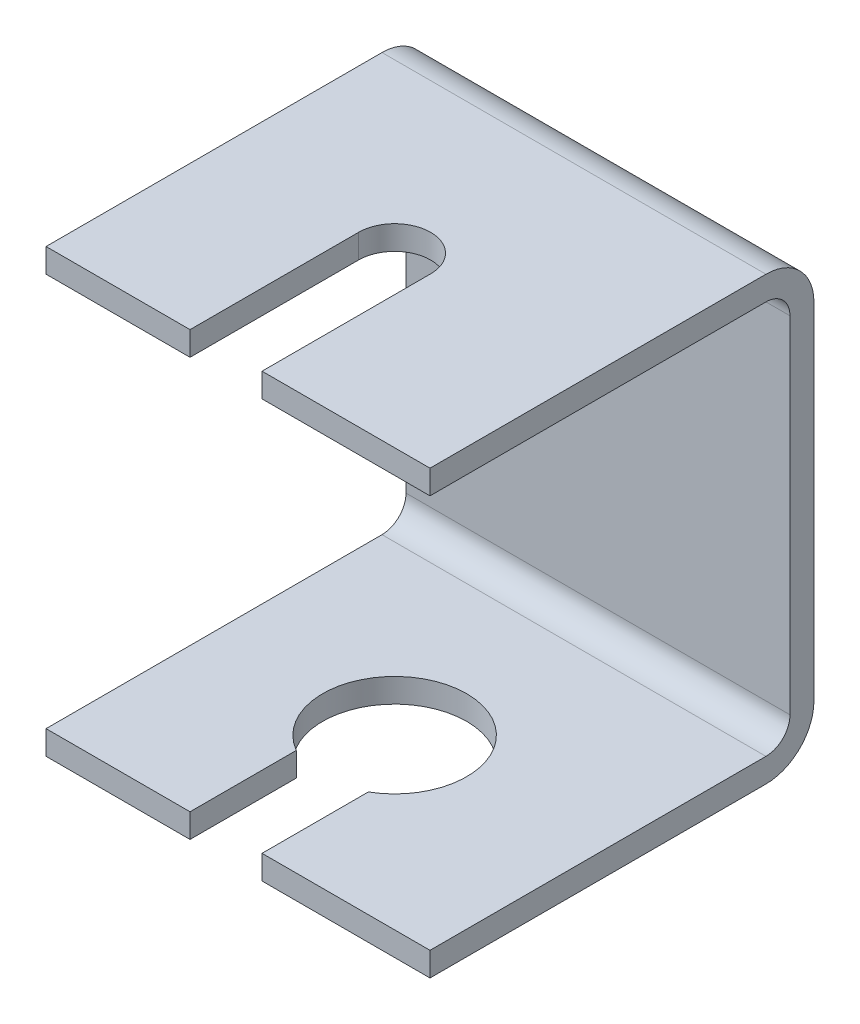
ISO-10303-21;
HEADER;
FILE_DESCRIPTION(('STEP AP214'),'2;1');
FILE_NAME('part.step','',(''),(''),'','','');
FILE_SCHEMA(('AUTOMOTIVE_DESIGN { 1 0 10303 214 1 1 1 1 }'));
ENDSEC;
DATA;
#1=APPLICATION_CONTEXT('core data for automotive mechanical design processes');
#2=APPLICATION_PROTOCOL_DEFINITION('international standard','automotive_design',2000,#1);
#3=PRODUCT_CONTEXT('',#1,'mechanical');
#4=PRODUCT('Part','Part','',(#3));
#5=PRODUCT_RELATED_PRODUCT_CATEGORY('part','',(#4));
#6=PRODUCT_DEFINITION_FORMATION('','',#4);
#7=PRODUCT_DEFINITION_CONTEXT('part definition',#1,'design');
#8=PRODUCT_DEFINITION('design','',#6,#7);
#9=PRODUCT_DEFINITION_SHAPE('','',#8);
#10=(LENGTH_UNIT() NAMED_UNIT(*) SI_UNIT(.MILLI.,.METRE.));
#11=(NAMED_UNIT(*) PLANE_ANGLE_UNIT() SI_UNIT($,.RADIAN.));
#12=(NAMED_UNIT(*) SI_UNIT($,.STERADIAN.) SOLID_ANGLE_UNIT());
#13=UNCERTAINTY_MEASURE_WITH_UNIT(LENGTH_MEASURE(1.E-05),#10,'distance_accuracy_value','');
#14=(GEOMETRIC_REPRESENTATION_CONTEXT(3) GLOBAL_UNCERTAINTY_ASSIGNED_CONTEXT((#13)) GLOBAL_UNIT_ASSIGNED_CONTEXT((#10,
#11,#12)) REPRESENTATION_CONTEXT('',''));
#15=CARTESIAN_POINT('',(0.,0.,0.));
#16=DIRECTION('',(0.,0.,1.));
#17=DIRECTION('',(1.,0.,0.));
#18=AXIS2_PLACEMENT_3D('',#15,#16,#17);
#19=CARTESIAN_POINT('',(25.4,0.,0.));
#20=DIRECTION('',(0.,0.,-1.));
#21=DIRECTION('',(-1.,0.,0.));
#22=AXIS2_PLACEMENT_3D('',#19,#20,#21);
#23=PLANE('',#22);
#24=DIRECTION('',(-1.,0.,0.));
#25=VECTOR('',#24,1.);
#26=CARTESIAN_POINT('',(25.4,1.5875,0.));
#27=LINE('',#26,#25);
#28=CARTESIAN_POINT('',(25.4,1.5875,0.));
#29=VERTEX_POINT('',#28);
#30=CARTESIAN_POINT('',(14.2875,1.5875,0.));
#31=VERTEX_POINT('',#30);
#32=EDGE_CURVE('E266',#29,#31,#27,.T.);
#33=ORIENTED_EDGE('',*,*,#32,.T.);
#34=DIRECTION('',(0.,-1.,0.));
#35=VECTOR('',#34,1.);
#36=CARTESIAN_POINT('',(14.2875,0.,0.));
#37=LINE('',#36,#35);
#38=CARTESIAN_POINT('',(14.2875,0.,0.));
#39=VERTEX_POINT('',#38);
#40=EDGE_CURVE('E209',#31,#39,#37,.T.);
#41=ORIENTED_EDGE('',*,*,#40,.T.);
#42=DIRECTION('',(-1.,0.,0.));
#43=VECTOR('',#42,1.);
#44=CARTESIAN_POINT('',(25.4,0.,0.));
#45=LINE('',#44,#43);
#46=CARTESIAN_POINT('',(25.4,0.,0.));
#47=VERTEX_POINT('',#46);
#48=EDGE_CURVE('E187',#47,#39,#45,.T.);
#49=ORIENTED_EDGE('',*,*,#48,.F.);
#50=DIRECTION('',(0.,-1.,0.));
#51=VECTOR('',#50,1.);
#52=CARTESIAN_POINT('',(25.4,0.,0.));
#53=LINE('',#52,#51);
#54=EDGE_CURVE('E221',#29,#47,#53,.T.);
#55=ORIENTED_EDGE('',*,*,#54,.F.);
#56=EDGE_LOOP('',(#33,#41,#49,#55));
#57=FACE_BOUND('',#56,.T.);
#58=ADVANCED_FACE('F34',(#57),#23,.F.);
#59=CARTESIAN_POINT('',(25.4,27.6225,0.));
#60=DIRECTION('',(0.,0.,-1.));
#61=DIRECTION('',(-1.,0.,0.));
#62=AXIS2_PLACEMENT_3D('',#59,#60,#61);
#63=PLANE('',#62);
#64=DIRECTION('',(-1.,0.,0.));
#65=VECTOR('',#64,1.);
#66=CARTESIAN_POINT('',(25.4,29.21,0.));
#67=LINE('',#66,#65);
#68=CARTESIAN_POINT('',(25.4,29.21,0.));
#69=VERTEX_POINT('',#68);
#70=CARTESIAN_POINT('',(14.2875,29.21,0.));
#71=VERTEX_POINT('',#70);
#72=EDGE_CURVE('E274',#69,#71,#67,.T.);
#73=ORIENTED_EDGE('',*,*,#72,.T.);
#74=DIRECTION('',(0.,-1.,0.));
#75=VECTOR('',#74,1.);
#76=CARTESIAN_POINT('',(14.2875,27.6225,0.));
#77=LINE('',#76,#75);
#78=CARTESIAN_POINT('',(14.2875,27.6225,0.));
#79=VERTEX_POINT('',#78);
#80=EDGE_CURVE('E214',#71,#79,#77,.T.);
#81=ORIENTED_EDGE('',*,*,#80,.T.);
#82=DIRECTION('',(-1.,0.,0.));
#83=VECTOR('',#82,1.);
#84=CARTESIAN_POINT('',(25.4,27.6225,0.));
#85=LINE('',#84,#83);
#86=CARTESIAN_POINT('',(25.4,27.6225,0.));
#87=VERTEX_POINT('',#86);
#88=EDGE_CURVE('E270',#87,#79,#85,.T.);
#89=ORIENTED_EDGE('',*,*,#88,.F.);
#90=DIRECTION('',(0.,-1.,0.));
#91=VECTOR('',#90,1.);
#92=CARTESIAN_POINT('',(25.4,27.6225,0.));
#93=LINE('',#92,#91);
#94=EDGE_CURVE('E233',#69,#87,#93,.T.);
#95=ORIENTED_EDGE('',*,*,#94,.F.);
#96=EDGE_LOOP('',(#73,#81,#89,#95));
#97=FACE_BOUND('',#96,.T.);
#98=ADVANCED_FACE('F394',(#97),#63,.F.);
#99=CARTESIAN_POINT('',(9.52500000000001,0.,0.));
#100=VERTEX_POINT('',#99);
#101=CARTESIAN_POINT('',(0.,0.,0.));
#102=VERTEX_POINT('',#101);
#103=EDGE_CURVE('E277',#100,#102,#45,.T.);
#104=ORIENTED_EDGE('',*,*,#103,.F.);
#105=DIRECTION('',(0.,1.,0.));
#106=VECTOR('',#105,1.);
#107=CARTESIAN_POINT('',(9.52500000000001,0.,0.));
#108=LINE('',#107,#106);
#109=CARTESIAN_POINT('',(9.52500000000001,1.5875,0.));
#110=VERTEX_POINT('',#109);
#111=EDGE_CURVE('E202',#100,#110,#108,.T.);
#112=ORIENTED_EDGE('',*,*,#111,.T.);
#113=CARTESIAN_POINT('',(0.,1.5875,0.));
#114=VERTEX_POINT('',#113);
#115=EDGE_CURVE('E243',#110,#114,#27,.T.);
#116=ORIENTED_EDGE('',*,*,#115,.T.);
#117=DIRECTION('',(0.,-1.,0.));
#118=VECTOR('',#117,1.);
#119=CARTESIAN_POINT('',(0.,0.,0.));
#120=LINE('',#119,#118);
#121=EDGE_CURVE('E220',#114,#102,#120,.T.);
#122=ORIENTED_EDGE('',*,*,#121,.T.);
#123=EDGE_LOOP('',(#104,#112,#116,#122));
#124=FACE_BOUND('',#123,.T.);
#125=ADVANCED_FACE('F376',(#124),#23,.F.);
#126=CARTESIAN_POINT('',(25.4,0.,0.));
#127=DIRECTION('',(0.,1.,0.));
#128=DIRECTION('',(0.,0.,1.));
#129=AXIS2_PLACEMENT_3D('',#126,#127,#128);
#130=PLANE('',#129);
#131=DIRECTION('',(0.,0.,-1.));
#132=VECTOR('',#131,1.);
#133=CARTESIAN_POINT('',(14.2875,0.,-11.1541984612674));
#134=LINE('',#133,#132);
#135=CARTESIAN_POINT('',(14.2875,0.,-7.02975247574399));
#136=VERTEX_POINT('',#135);
#137=EDGE_CURVE('E180',#39,#136,#134,.T.);
#138=ORIENTED_EDGE('',*,*,#137,.T.);
#139=CARTESIAN_POINT('',(11.90625,0.,-11.1541984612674));
#140=DIRECTION('',(0.,-1.,0.));
#141=DIRECTION('',(0.,0.,-1.));
#142=AXIS2_PLACEMENT_3D('',#139,#140,#141);
#143=CIRCLE('',#142,4.7625);
#144=CARTESIAN_POINT('',(9.52500000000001,0.,-7.02975247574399));
#145=VERTEX_POINT('',#144);
#146=EDGE_CURVE('E168',#145,#136,#143,.T.);
#147=ORIENTED_EDGE('',*,*,#146,.F.);
#148=DIRECTION('',(0.,0.,1.));
#149=VECTOR('',#148,1.);
#150=CARTESIAN_POINT('',(9.52500000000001,0.,-11.1541984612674));
#151=LINE('',#150,#149);
#152=EDGE_CURVE('E189',#145,#100,#151,.T.);
#153=ORIENTED_EDGE('',*,*,#152,.T.);
#154=ORIENTED_EDGE('',*,*,#103,.T.);
#155=DIRECTION('',(0.,0.,-1.));
#156=VECTOR('',#155,1.);
#157=CARTESIAN_POINT('',(0.,0.,0.));
#158=LINE('',#157,#156);
#159=CARTESIAN_POINT('',(0.,0.,-22.225));
#160=VERTEX_POINT('',#159);
#161=EDGE_CURVE('E246',#102,#160,#158,.T.);
#162=ORIENTED_EDGE('',*,*,#161,.T.);
#163=DIRECTION('',(-1.,0.,0.));
#164=VECTOR('',#163,1.);
#165=CARTESIAN_POINT('',(25.4,0.,-22.225));
#166=LINE('',#165,#164);
#167=CARTESIAN_POINT('',(25.4,0.,-22.225));
#168=VERTEX_POINT('',#167);
#169=EDGE_CURVE('E313',#160,#168,#166,.F.);
#170=ORIENTED_EDGE('',*,*,#169,.T.);
#171=DIRECTION('',(0.,0.,-1.));
#172=VECTOR('',#171,1.);
#173=CARTESIAN_POINT('',(25.4,0.,0.));
#174=LINE('',#173,#172);
#175=EDGE_CURVE('E224',#47,#168,#174,.T.);
#176=ORIENTED_EDGE('',*,*,#175,.F.);
#177=ORIENTED_EDGE('',*,*,#48,.T.);
#178=EDGE_LOOP('',(#138,#147,#153,#154,#162,#170,#176,#177));
#179=FACE_BOUND('',#178,.T.);
#180=ADVANCED_FACE('F185',(#179),#130,.F.);
#181=CARTESIAN_POINT('',(25.4,0.,-25.4));
#182=DIRECTION('',(0.,0.,1.));
#183=DIRECTION('',(1.,0.,0.));
#184=AXIS2_PLACEMENT_3D('',#181,#182,#183);
#185=PLANE('',#184);
#186=DIRECTION('',(0.,1.,0.));
#187=VECTOR('',#186,1.);
#188=CARTESIAN_POINT('',(0.,0.,-25.4));
#189=LINE('',#188,#187);
#190=CARTESIAN_POINT('',(0.,3.175,-25.4));
#191=VERTEX_POINT('',#190);
#192=CARTESIAN_POINT('',(0.,26.035,-25.4));
#193=VERTEX_POINT('',#192);
#194=EDGE_CURVE('E249',#191,#193,#189,.T.);
#195=ORIENTED_EDGE('',*,*,#194,.T.);
#196=DIRECTION('',(-1.,0.,0.));
#197=VECTOR('',#196,1.);
#198=CARTESIAN_POINT('',(25.4,26.035,-25.4));
#199=LINE('',#198,#197);
#200=CARTESIAN_POINT('',(25.4,26.035,-25.4));
#201=VERTEX_POINT('',#200);
#202=EDGE_CURVE('E307',#193,#201,#199,.F.);
#203=ORIENTED_EDGE('',*,*,#202,.T.);
#204=DIRECTION('',(0.,1.,0.));
#205=VECTOR('',#204,1.);
#206=CARTESIAN_POINT('',(25.4,0.,-25.4));
#207=LINE('',#206,#205);
#208=CARTESIAN_POINT('',(25.4,3.175,-25.4));
#209=VERTEX_POINT('',#208);
#210=EDGE_CURVE('E228',#209,#201,#207,.T.);
#211=ORIENTED_EDGE('',*,*,#210,.F.);
#212=DIRECTION('',(-1.,0.,0.));
#213=VECTOR('',#212,1.);
#214=CARTESIAN_POINT('',(25.4,3.175,-25.4));
#215=LINE('',#214,#213);
#216=EDGE_CURVE('E304',#209,#191,#215,.T.);
#217=ORIENTED_EDGE('',*,*,#216,.T.);
#218=EDGE_LOOP('',(#195,#203,#211,#217));
#219=FACE_BOUND('',#218,.T.);
#220=ADVANCED_FACE('F368',(#219),#185,.F.);
#221=CARTESIAN_POINT('',(25.4,29.21,0.));
#222=DIRECTION('',(0.,-1.,0.));
#223=DIRECTION('',(0.,0.,-1.));
#224=AXIS2_PLACEMENT_3D('',#221,#222,#223);
#225=PLANE('',#224);
#226=CARTESIAN_POINT('',(11.90625,29.21,-11.1541984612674));
#227=DIRECTION('',(0.,1.,0.));
#228=DIRECTION('',(0.,0.,1.));
#229=AXIS2_PLACEMENT_3D('',#226,#227,#228);
#230=CIRCLE('',#229,2.38125);
#231=CARTESIAN_POINT('',(14.2875,29.21,-11.1541984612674));
#232=VERTEX_POINT('',#231);
#233=CARTESIAN_POINT('',(9.52500000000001,29.21,-11.1541984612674));
#234=VERTEX_POINT('',#233);
#235=EDGE_CURVE('E182',#232,#234,#230,.T.);
#236=ORIENTED_EDGE('',*,*,#235,.F.);
#237=DIRECTION('',(0.,0.,-1.));
#238=VECTOR('',#237,1.);
#239=CARTESIAN_POINT('',(14.2875,29.21,-11.1541984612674));
#240=LINE('',#239,#238);
#241=EDGE_CURVE('E193',#71,#232,#240,.T.);
#242=ORIENTED_EDGE('',*,*,#241,.F.);
#243=ORIENTED_EDGE('',*,*,#72,.F.);
#244=DIRECTION('',(0.,0.,1.));
#245=VECTOR('',#244,1.);
#246=CARTESIAN_POINT('',(25.4,29.21,0.));
#247=LINE('',#246,#245);
#248=CARTESIAN_POINT('',(25.4,29.21,-22.225));
#249=VERTEX_POINT('',#248);
#250=EDGE_CURVE('E231',#249,#69,#247,.T.);
#251=ORIENTED_EDGE('',*,*,#250,.F.);
#252=DIRECTION('',(-1.,0.,0.));
#253=VECTOR('',#252,1.);
#254=CARTESIAN_POINT('',(25.4,29.21,-22.225));
#255=LINE('',#254,#253);
#256=CARTESIAN_POINT('',(0.,29.21,-22.225));
#257=VERTEX_POINT('',#256);
#258=EDGE_CURVE('E297',#249,#257,#255,.T.);
#259=ORIENTED_EDGE('',*,*,#258,.T.);
#260=DIRECTION('',(0.,0.,1.));
#261=VECTOR('',#260,1.);
#262=CARTESIAN_POINT('',(0.,29.21,0.));
#263=LINE('',#262,#261);
#264=CARTESIAN_POINT('',(0.,29.21,0.));
#265=VERTEX_POINT('',#264);
#266=EDGE_CURVE('E252',#257,#265,#263,.T.);
#267=ORIENTED_EDGE('',*,*,#266,.T.);
#268=CARTESIAN_POINT('',(9.52500000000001,29.21,0.));
#269=VERTEX_POINT('',#268);
#270=EDGE_CURVE('E273',#269,#265,#67,.T.);
#271=ORIENTED_EDGE('',*,*,#270,.F.);
#272=DIRECTION('',(0.,0.,1.));
#273=VECTOR('',#272,1.);
#274=CARTESIAN_POINT('',(9.52500000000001,29.21,-11.1541984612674));
#275=LINE('',#274,#273);
#276=EDGE_CURVE('E198',#234,#269,#275,.T.);
#277=ORIENTED_EDGE('',*,*,#276,.F.);
#278=EDGE_LOOP('',(#236,#242,#243,#251,#259,#267,#271,#277));
#279=FACE_BOUND('',#278,.T.);
#280=ADVANCED_FACE('F357',(#279),#225,.F.);
#281=CARTESIAN_POINT('',(9.52500000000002,27.6225,0.));
#282=VERTEX_POINT('',#281);
#283=CARTESIAN_POINT('',(0.,27.6225,0.));
#284=VERTEX_POINT('',#283);
#285=EDGE_CURVE('E269',#282,#284,#85,.T.);
#286=ORIENTED_EDGE('',*,*,#285,.F.);
#287=DIRECTION('',(0.,1.,0.));
#288=VECTOR('',#287,1.);
#289=CARTESIAN_POINT('',(9.52500000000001,27.6225,0.));
#290=LINE('',#289,#288);
#291=EDGE_CURVE('E56',#282,#269,#290,.T.);
#292=ORIENTED_EDGE('',*,*,#291,.T.);
#293=ORIENTED_EDGE('',*,*,#270,.T.);
#294=DIRECTION('',(0.,-1.,0.));
#295=VECTOR('',#294,1.);
#296=CARTESIAN_POINT('',(0.,27.6225,0.));
#297=LINE('',#296,#295);
#298=EDGE_CURVE('E255',#265,#284,#297,.T.);
#299=ORIENTED_EDGE('',*,*,#298,.T.);
#300=EDGE_LOOP('',(#286,#292,#293,#299));
#301=FACE_BOUND('',#300,.T.);
#302=ADVANCED_FACE('F352',(#301),#63,.F.);
#303=CARTESIAN_POINT('',(25.4,27.6225,0.));
#304=DIRECTION('',(0.,1.,0.));
#305=DIRECTION('',(0.,0.,1.));
#306=AXIS2_PLACEMENT_3D('',#303,#304,#305);
#307=PLANE('',#306);
#308=ORIENTED_EDGE('',*,*,#88,.T.);
#309=DIRECTION('',(0.,0.,-1.));
#310=VECTOR('',#309,1.);
#311=CARTESIAN_POINT('',(14.2875,27.6225,0.));
#312=LINE('',#311,#310);
#313=CARTESIAN_POINT('',(14.2875,27.6225,-11.1541984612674));
#314=VERTEX_POINT('',#313);
#315=EDGE_CURVE('E211',#79,#314,#312,.T.);
#316=ORIENTED_EDGE('',*,*,#315,.T.);
#317=CARTESIAN_POINT('',(11.90625,27.6225,-11.1541984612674));
#318=DIRECTION('',(0.,1.,0.));
#319=DIRECTION('',(0.,0.,1.));
#320=AXIS2_PLACEMENT_3D('',#317,#318,#319);
#321=CIRCLE('',#320,2.38125);
#322=CARTESIAN_POINT('',(9.52500000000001,27.6225,-11.1541984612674));
#323=VERTEX_POINT('',#322);
#324=EDGE_CURVE('E217',#314,#323,#321,.T.);
#325=ORIENTED_EDGE('',*,*,#324,.T.);
#326=DIRECTION('',(0.,0.,1.));
#327=VECTOR('',#326,1.);
#328=CARTESIAN_POINT('',(9.52500000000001,27.6225,0.));
#329=LINE('',#328,#327);
#330=EDGE_CURVE('E206',#323,#282,#329,.T.);
#331=ORIENTED_EDGE('',*,*,#330,.T.);
#332=ORIENTED_EDGE('',*,*,#285,.T.);
#333=DIRECTION('',(0.,0.,-1.));
#334=VECTOR('',#333,1.);
#335=CARTESIAN_POINT('',(0.,27.6225,0.));
#336=LINE('',#335,#334);
#337=CARTESIAN_POINT('',(0.,27.6225,-22.225));
#338=VERTEX_POINT('',#337);
#339=EDGE_CURVE('E258',#284,#338,#336,.T.);
#340=ORIENTED_EDGE('',*,*,#339,.T.);
#341=DIRECTION('',(-1.,0.,0.));
#342=VECTOR('',#341,1.);
#343=CARTESIAN_POINT('',(25.4,27.6225,-22.225));
#344=LINE('',#343,#342);
#345=CARTESIAN_POINT('',(25.4,27.6225,-22.225));
#346=VERTEX_POINT('',#345);
#347=EDGE_CURVE('E284',#338,#346,#344,.F.);
#348=ORIENTED_EDGE('',*,*,#347,.T.);
#349=DIRECTION('',(0.,0.,-1.));
#350=VECTOR('',#349,1.);
#351=CARTESIAN_POINT('',(25.4,27.6225,0.));
#352=LINE('',#351,#350);
#353=EDGE_CURVE('E235',#87,#346,#352,.T.);
#354=ORIENTED_EDGE('',*,*,#353,.F.);
#355=EDGE_LOOP('',(#308,#316,#325,#331,#332,#340,#348,#354));
#356=FACE_BOUND('',#355,.T.);
#357=ADVANCED_FACE('F348',(#356),#307,.F.);
#358=CARTESIAN_POINT('',(25.4,27.6225,-23.8125));
#359=DIRECTION('',(0.,0.,-1.));
#360=DIRECTION('',(0.,1.,0.));
#361=AXIS2_PLACEMENT_3D('',#358,#359,#360);
#362=PLANE('',#361);
#363=DIRECTION('',(0.,-1.,0.));
#364=VECTOR('',#363,1.);
#365=CARTESIAN_POINT('',(25.4,27.6225,-23.8125));
#366=LINE('',#365,#364);
#367=CARTESIAN_POINT('',(25.4,26.035,-23.8125));
#368=VERTEX_POINT('',#367);
#369=CARTESIAN_POINT('',(25.4,3.17500000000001,-23.8125));
#370=VERTEX_POINT('',#369);
#371=EDGE_CURVE('E238',#368,#370,#366,.T.);
#372=ORIENTED_EDGE('',*,*,#371,.F.);
#373=DIRECTION('',(-1.,0.,0.));
#374=VECTOR('',#373,1.);
#375=CARTESIAN_POINT('',(0.,26.035,-23.8125));
#376=LINE('',#375,#374);
#377=CARTESIAN_POINT('',(0.,26.035,-23.8125));
#378=VERTEX_POINT('',#377);
#379=EDGE_CURVE('E281',#368,#378,#376,.T.);
#380=ORIENTED_EDGE('',*,*,#379,.T.);
#381=DIRECTION('',(0.,-1.,0.));
#382=VECTOR('',#381,1.);
#383=CARTESIAN_POINT('',(0.,27.6225,-23.8125));
#384=LINE('',#383,#382);
#385=CARTESIAN_POINT('',(0.,3.17500000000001,-23.8125));
#386=VERTEX_POINT('',#385);
#387=EDGE_CURVE('E261',#378,#386,#384,.T.);
#388=ORIENTED_EDGE('',*,*,#387,.T.);
#389=DIRECTION('',(-1.,0.,0.));
#390=VECTOR('',#389,1.);
#391=CARTESIAN_POINT('',(25.4,3.175,-23.8125));
#392=LINE('',#391,#390);
#393=EDGE_CURVE('E279',#386,#370,#392,.F.);
#394=ORIENTED_EDGE('',*,*,#393,.T.);
#395=EDGE_LOOP('',(#372,#380,#388,#394));
#396=FACE_BOUND('',#395,.T.);
#397=ADVANCED_FACE('F339',(#396),#362,.F.);
#398=CARTESIAN_POINT('',(25.4,1.5875,0.));
#399=DIRECTION('',(0.,-1.,0.));
#400=DIRECTION('',(0.,0.,-1.));
#401=AXIS2_PLACEMENT_3D('',#398,#399,#400);
#402=PLANE('',#401);
#403=DIRECTION('',(0.,0.,-1.));
#404=VECTOR('',#403,1.);
#405=CARTESIAN_POINT('',(9.52500000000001,1.5875,0.));
#406=LINE('',#405,#404);
#407=CARTESIAN_POINT('',(9.52500000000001,1.5875,-7.02975247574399));
#408=VERTEX_POINT('',#407);
#409=EDGE_CURVE('E315',#110,#408,#406,.T.);
#410=ORIENTED_EDGE('',*,*,#409,.T.);
#411=CARTESIAN_POINT('',(11.90625,1.5875,-11.1541984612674));
#412=DIRECTION('',(0.,-1.,0.));
#413=DIRECTION('',(0.,0.,-1.));
#414=AXIS2_PLACEMENT_3D('',#411,#412,#413);
#415=CIRCLE('',#414,4.7625);
#416=CARTESIAN_POINT('',(14.2875,1.5875,-7.02975247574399));
#417=VERTEX_POINT('',#416);
#418=EDGE_CURVE('E49',#408,#417,#415,.T.);
#419=ORIENTED_EDGE('',*,*,#418,.T.);
#420=DIRECTION('',(0.,0.,1.));
#421=VECTOR('',#420,1.);
#422=CARTESIAN_POINT('',(14.2875,1.5875,0.));
#423=LINE('',#422,#421);
#424=EDGE_CURVE('E42',#417,#31,#423,.T.);
#425=ORIENTED_EDGE('',*,*,#424,.T.);
#426=ORIENTED_EDGE('',*,*,#32,.F.);
#427=DIRECTION('',(0.,0.,1.));
#428=VECTOR('',#427,1.);
#429=CARTESIAN_POINT('',(25.4,1.5875,0.));
#430=LINE('',#429,#428);
#431=CARTESIAN_POINT('',(25.4,1.5875,-22.225));
#432=VERTEX_POINT('',#431);
#433=EDGE_CURVE('E241',#432,#29,#430,.T.);
#434=ORIENTED_EDGE('',*,*,#433,.F.);
#435=DIRECTION('',(-1.,0.,0.));
#436=VECTOR('',#435,1.);
#437=CARTESIAN_POINT('',(0.,1.5875,-22.225));
#438=LINE('',#437,#436);
#439=CARTESIAN_POINT('',(0.,1.5875,-22.225));
#440=VERTEX_POINT('',#439);
#441=EDGE_CURVE('E286',#432,#440,#438,.T.);
#442=ORIENTED_EDGE('',*,*,#441,.T.);
#443=DIRECTION('',(0.,0.,1.));
#444=VECTOR('',#443,1.);
#445=CARTESIAN_POINT('',(0.,1.5875,0.));
#446=LINE('',#445,#444);
#447=EDGE_CURVE('E225',#440,#114,#446,.T.);
#448=ORIENTED_EDGE('',*,*,#447,.T.);
#449=ORIENTED_EDGE('',*,*,#115,.F.);
#450=EDGE_LOOP('',(#410,#419,#425,#426,#434,#442,#448,#449));
#451=FACE_BOUND('',#450,.T.);
#452=ADVANCED_FACE('F319',(#451),#402,.F.);
#453=CARTESIAN_POINT('',(25.4,1.5875,0.));
#454=DIRECTION('',(-1.,0.,0.));
#455=DIRECTION('',(0.,0.,1.));
#456=AXIS2_PLACEMENT_3D('',#453,#454,#455);
#457=PLANE('',#456);
#458=ORIENTED_EDGE('',*,*,#210,.T.);
#459=CARTESIAN_POINT('',(25.4,26.035,-22.225));
#460=DIRECTION('',(-1.,0.,0.));
#461=DIRECTION('',(0.,0.,1.));
#462=AXIS2_PLACEMENT_3D('',#459,#460,#461);
#463=CIRCLE('',#462,3.175);
#464=EDGE_CURVE('E311',#201,#249,#463,.F.);
#465=ORIENTED_EDGE('',*,*,#464,.T.);
#466=ORIENTED_EDGE('',*,*,#250,.T.);
#467=ORIENTED_EDGE('',*,*,#94,.T.);
#468=ORIENTED_EDGE('',*,*,#353,.T.);
#469=CARTESIAN_POINT('',(25.4,26.035,-22.225));
#470=DIRECTION('',(-1.,0.,0.));
#471=DIRECTION('',(0.,0.,1.));
#472=AXIS2_PLACEMENT_3D('',#469,#470,#471);
#473=CIRCLE('',#472,1.5875);
#474=EDGE_CURVE('E291',#346,#368,#473,.T.);
#475=ORIENTED_EDGE('',*,*,#474,.T.);
#476=ORIENTED_EDGE('',*,*,#371,.T.);
#477=CARTESIAN_POINT('',(25.4,3.175,-22.225));
#478=DIRECTION('',(-1.,0.,0.));
#479=DIRECTION('',(0.,0.,1.));
#480=AXIS2_PLACEMENT_3D('',#477,#478,#479);
#481=CIRCLE('',#480,1.5875);
#482=EDGE_CURVE('E295',#370,#432,#481,.T.);
#483=ORIENTED_EDGE('',*,*,#482,.T.);
#484=ORIENTED_EDGE('',*,*,#433,.T.);
#485=ORIENTED_EDGE('',*,*,#54,.T.);
#486=ORIENTED_EDGE('',*,*,#175,.T.);
#487=CARTESIAN_POINT('',(25.4,3.175,-22.225));
#488=DIRECTION('',(-1.,0.,0.));
#489=DIRECTION('',(0.,0.,1.));
#490=AXIS2_PLACEMENT_3D('',#487,#488,#489);
#491=CIRCLE('',#490,3.175);
#492=EDGE_CURVE('E309',#168,#209,#491,.F.);
#493=ORIENTED_EDGE('',*,*,#492,.T.);
#494=EDGE_LOOP('',(#458,#465,#466,#467,#468,#475,#476,#483,#484,#485,#486,#493));
#495=FACE_BOUND('',#494,.T.);
#496=ADVANCED_FACE('F324',(#495),#457,.F.);
#497=CARTESIAN_POINT('',(0.,1.5875,0.));
#498=DIRECTION('',(-1.,0.,0.));
#499=DIRECTION('',(0.,0.,1.));
#500=AXIS2_PLACEMENT_3D('',#497,#498,#499);
#501=PLANE('',#500);
#502=ORIENTED_EDGE('',*,*,#266,.F.);
#503=CARTESIAN_POINT('',(0.,26.035,-22.225));
#504=DIRECTION('',(-1.,0.,0.));
#505=DIRECTION('',(0.,0.,1.));
#506=AXIS2_PLACEMENT_3D('',#503,#504,#505);
#507=CIRCLE('',#506,3.175);
#508=EDGE_CURVE('E302',#257,#193,#507,.T.);
#509=ORIENTED_EDGE('',*,*,#508,.T.);
#510=ORIENTED_EDGE('',*,*,#194,.F.);
#511=CARTESIAN_POINT('',(0.,3.175,-22.225));
#512=DIRECTION('',(-1.,0.,0.));
#513=DIRECTION('',(0.,0.,1.));
#514=AXIS2_PLACEMENT_3D('',#511,#512,#513);
#515=CIRCLE('',#514,3.175);
#516=EDGE_CURVE('E300',#191,#160,#515,.T.);
#517=ORIENTED_EDGE('',*,*,#516,.T.);
#518=ORIENTED_EDGE('',*,*,#161,.F.);
#519=ORIENTED_EDGE('',*,*,#121,.F.);
#520=ORIENTED_EDGE('',*,*,#447,.F.);
#521=CARTESIAN_POINT('',(0.,3.175,-22.225));
#522=DIRECTION('',(-1.,0.,0.));
#523=DIRECTION('',(0.,0.,1.));
#524=AXIS2_PLACEMENT_3D('',#521,#522,#523);
#525=CIRCLE('',#524,1.5875);
#526=EDGE_CURVE('E293',#440,#386,#525,.F.);
#527=ORIENTED_EDGE('',*,*,#526,.T.);
#528=ORIENTED_EDGE('',*,*,#387,.F.);
#529=CARTESIAN_POINT('',(0.,26.035,-22.225));
#530=DIRECTION('',(-1.,0.,0.));
#531=DIRECTION('',(0.,0.,1.));
#532=AXIS2_PLACEMENT_3D('',#529,#530,#531);
#533=CIRCLE('',#532,1.5875);
#534=EDGE_CURVE('E289',#378,#338,#533,.F.);
#535=ORIENTED_EDGE('',*,*,#534,.T.);
#536=ORIENTED_EDGE('',*,*,#339,.F.);
#537=ORIENTED_EDGE('',*,*,#298,.F.);
#538=EDGE_LOOP('',(#502,#509,#510,#517,#518,#519,#520,#527,#528,#535,#536,#537));
#539=FACE_BOUND('',#538,.T.);
#540=ADVANCED_FACE('F335',(#539),#501,.T.);
#541=CARTESIAN_POINT('',(25.4,26.035,-22.225));
#542=DIRECTION('',(1.,0.,0.));
#543=DIRECTION('',(0.,0.,-1.));
#544=AXIS2_PLACEMENT_3D('',#541,#542,#543);
#545=CYLINDRICAL_SURFACE('',#544,1.5875);
#546=ORIENTED_EDGE('',*,*,#474,.F.);
#547=ORIENTED_EDGE('',*,*,#347,.F.);
#548=ORIENTED_EDGE('',*,*,#534,.F.);
#549=ORIENTED_EDGE('',*,*,#379,.F.);
#550=EDGE_LOOP('',(#546,#547,#548,#549));
#551=FACE_BOUND('',#550,.T.);
#552=ADVANCED_FACE('F343',(#551),#545,.F.);
#553=CARTESIAN_POINT('',(25.4,3.175,-22.225));
#554=DIRECTION('',(1.,0.,0.));
#555=DIRECTION('',(0.,0.,-1.));
#556=AXIS2_PLACEMENT_3D('',#553,#554,#555);
#557=CYLINDRICAL_SURFACE('',#556,1.5875);
#558=ORIENTED_EDGE('',*,*,#482,.F.);
#559=ORIENTED_EDGE('',*,*,#393,.F.);
#560=ORIENTED_EDGE('',*,*,#526,.F.);
#561=ORIENTED_EDGE('',*,*,#441,.F.);
#562=EDGE_LOOP('',(#558,#559,#560,#561));
#563=FACE_BOUND('',#562,.T.);
#564=ADVANCED_FACE('F330',(#563),#557,.F.);
#565=CARTESIAN_POINT('',(25.4,26.035,-22.225));
#566=DIRECTION('',(-1.,0.,0.));
#567=DIRECTION('',(0.,0.,1.));
#568=AXIS2_PLACEMENT_3D('',#565,#566,#567);
#569=CYLINDRICAL_SURFACE('',#568,3.175);
#570=ORIENTED_EDGE('',*,*,#464,.F.);
#571=ORIENTED_EDGE('',*,*,#202,.F.);
#572=ORIENTED_EDGE('',*,*,#508,.F.);
#573=ORIENTED_EDGE('',*,*,#258,.F.);
#574=EDGE_LOOP('',(#570,#571,#572,#573));
#575=FACE_BOUND('',#574,.T.);
#576=ADVANCED_FACE('F364',(#575),#569,.T.);
#577=CARTESIAN_POINT('',(25.4,3.175,-22.225));
#578=DIRECTION('',(-1.,0.,0.));
#579=DIRECTION('',(0.,0.,1.));
#580=AXIS2_PLACEMENT_3D('',#577,#578,#579);
#581=CYLINDRICAL_SURFACE('',#580,3.175);
#582=ORIENTED_EDGE('',*,*,#492,.F.);
#583=ORIENTED_EDGE('',*,*,#169,.F.);
#584=ORIENTED_EDGE('',*,*,#516,.F.);
#585=ORIENTED_EDGE('',*,*,#216,.F.);
#586=EDGE_LOOP('',(#582,#583,#584,#585));
#587=FACE_BOUND('',#586,.T.);
#588=ADVANCED_FACE('F36',(#587),#581,.T.);
#589=CARTESIAN_POINT('',(14.2875,0.,-11.1541984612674));
#590=DIRECTION('',(1.,0.,0.));
#591=DIRECTION('',(0.,0.,-1.));
#592=AXIS2_PLACEMENT_3D('',#589,#590,#591);
#593=PLANE('',#592);
#594=ORIENTED_EDGE('',*,*,#424,.F.);
#595=DIRECTION('',(0.,-1.,0.));
#596=VECTOR('',#595,1.);
#597=CARTESIAN_POINT('',(14.2875,25.4,-7.02975247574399));
#598=LINE('',#597,#596);
#599=EDGE_CURVE('E171',#417,#136,#598,.T.);
#600=ORIENTED_EDGE('',*,*,#599,.T.);
#601=ORIENTED_EDGE('',*,*,#137,.F.);
#602=ORIENTED_EDGE('',*,*,#40,.F.);
#603=EDGE_LOOP('',(#594,#600,#601,#602));
#604=FACE_BOUND('',#603,.T.);
#605=ADVANCED_FACE('F178',(#604),#593,.F.);
#606=CARTESIAN_POINT('',(9.52500000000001,0.,-11.1541984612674));
#607=DIRECTION('',(-1.,0.,0.));
#608=DIRECTION('',(0.,0.,1.));
#609=AXIS2_PLACEMENT_3D('',#606,#607,#608);
#610=PLANE('',#609);
#611=ORIENTED_EDGE('',*,*,#152,.F.);
#612=DIRECTION('',(0.,-1.,0.));
#613=VECTOR('',#612,1.);
#614=CARTESIAN_POINT('',(9.52500000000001,25.4,-7.02975247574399));
#615=LINE('',#614,#613);
#616=EDGE_CURVE('E11',#145,#408,#615,.F.);
#617=ORIENTED_EDGE('',*,*,#616,.T.);
#618=ORIENTED_EDGE('',*,*,#409,.F.);
#619=ORIENTED_EDGE('',*,*,#111,.F.);
#620=EDGE_LOOP('',(#611,#617,#618,#619));
#621=FACE_BOUND('',#620,.T.);
#622=ADVANCED_FACE('F379',(#621),#610,.F.);
#623=CARTESIAN_POINT('',(11.90625,0.,-11.1541984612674));
#624=DIRECTION('',(0.,1.,0.));
#625=DIRECTION('',(0.,0.,1.));
#626=AXIS2_PLACEMENT_3D('',#623,#624,#625);
#627=CYLINDRICAL_SURFACE('',#626,2.38125);
#628=DIRECTION('',(0.,1.,0.));
#629=VECTOR('',#628,1.);
#630=CARTESIAN_POINT('',(14.2875,0.,-11.1541984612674));
#631=LINE('',#630,#629);
#632=EDGE_CURVE('E191',#314,#232,#631,.T.);
#633=ORIENTED_EDGE('',*,*,#632,.T.);
#634=ORIENTED_EDGE('',*,*,#235,.T.);
#635=DIRECTION('',(0.,1.,0.));
#636=VECTOR('',#635,1.);
#637=CARTESIAN_POINT('',(9.52500000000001,0.,-11.1541984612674));
#638=LINE('',#637,#636);
#639=EDGE_CURVE('E188',#323,#234,#638,.T.);
#640=ORIENTED_EDGE('',*,*,#639,.F.);
#641=ORIENTED_EDGE('',*,*,#324,.F.);
#642=EDGE_LOOP('',(#633,#634,#640,#641));
#643=FACE_BOUND('',#642,.T.);
#644=ADVANCED_FACE('F381',(#643),#627,.F.);
#645=ORIENTED_EDGE('',*,*,#241,.T.);
#646=ORIENTED_EDGE('',*,*,#632,.F.);
#647=ORIENTED_EDGE('',*,*,#315,.F.);
#648=ORIENTED_EDGE('',*,*,#80,.F.);
#649=EDGE_LOOP('',(#645,#646,#647,#648));
#650=FACE_BOUND('',#649,.T.);
#651=ADVANCED_FACE('F388',(#650),#593,.F.);
#652=ORIENTED_EDGE('',*,*,#330,.F.);
#653=ORIENTED_EDGE('',*,*,#639,.T.);
#654=ORIENTED_EDGE('',*,*,#276,.T.);
#655=ORIENTED_EDGE('',*,*,#291,.F.);
#656=EDGE_LOOP('',(#652,#653,#654,#655));
#657=FACE_BOUND('',#656,.T.);
#658=ADVANCED_FACE('F383',(#657),#610,.F.);
#659=CARTESIAN_POINT('',(11.90625,25.4,-11.1541984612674));
#660=DIRECTION('',(0.,-1.,0.));
#661=DIRECTION('',(0.,0.,-1.));
#662=AXIS2_PLACEMENT_3D('',#659,#660,#661);
#663=CYLINDRICAL_SURFACE('',#662,4.7625);
#664=ORIENTED_EDGE('',*,*,#418,.F.);
#665=ORIENTED_EDGE('',*,*,#616,.F.);
#666=ORIENTED_EDGE('',*,*,#146,.T.);
#667=ORIENTED_EDGE('',*,*,#599,.F.);
#668=EDGE_LOOP('',(#664,#665,#666,#667));
#669=FACE_BOUND('',#668,.T.);
#670=ADVANCED_FACE('F170',(#669),#663,.F.);
#671=CLOSED_SHELL('',(#58,#98,#125,#180,#220,#280,#302,#357,#397,#452,#496,#540,#552,#564,#576,
#588,#605,#622,#644,#651,#658,#670));
#672=MANIFOLD_SOLID_BREP('B2',#671);
#673=ADVANCED_BREP_SHAPE_REPRESENTATION('',(#18,#672),#14);
#674=SHAPE_DEFINITION_REPRESENTATION(#9,#673);
ENDSEC;
END-ISO-10303-21;
